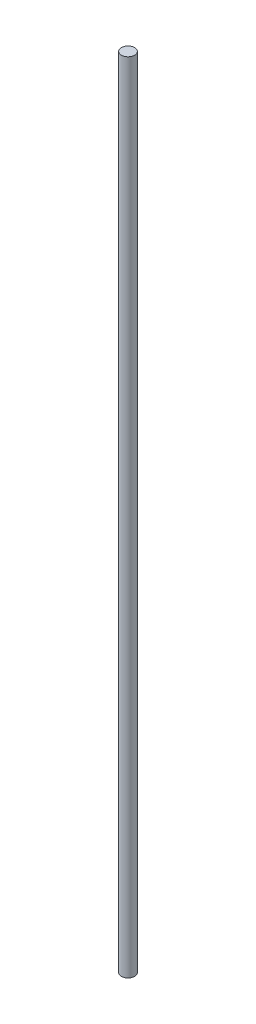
from build123d import *

# Parameters (mm, degrees)
SKETCH1_R           = 4
BOSS_EXTRUDE1_DEPTH = 482.6


with BuildPart() as part:
    # Sketch1 → Boss-Extrude1 (new body)
    with BuildSketch(Plane(origin=(0, 0, 0), x_dir=(1, 0, 0), z_dir=(0, 1, 0))):
        with Locations(Location((0, 0, 0), (0, 0, 90))):
            Circle(SKETCH1_R)
    extrude(amount=BOSS_EXTRUDE1_DEPTH)


solid = part.part
